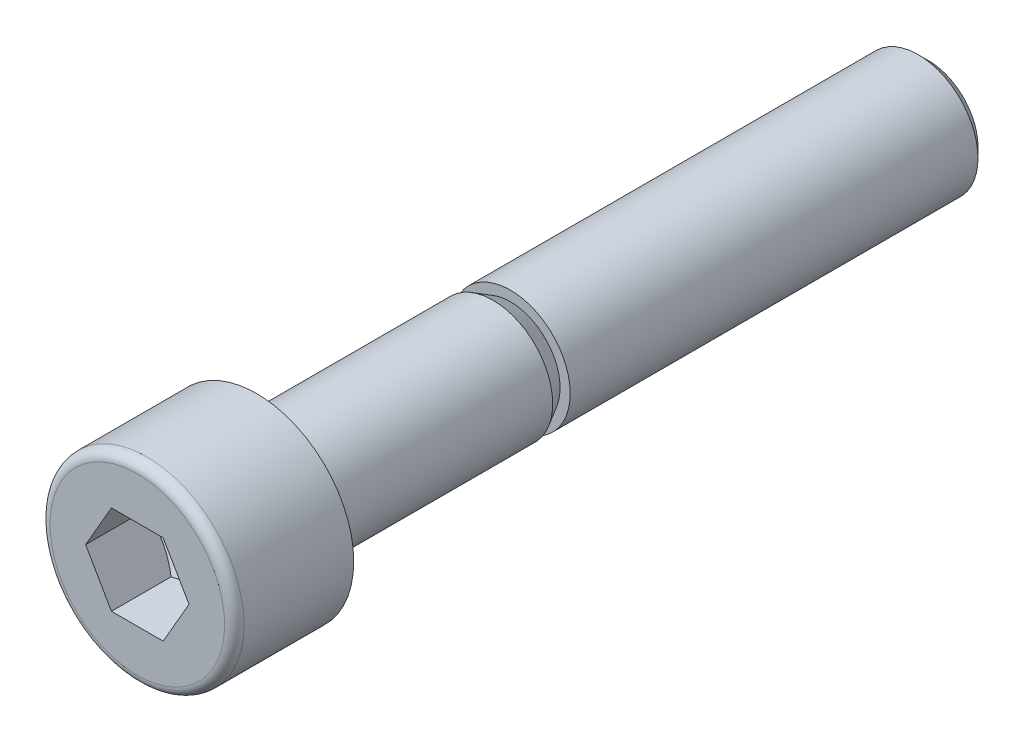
ISO-10303-21;
HEADER;
FILE_DESCRIPTION(('STEP AP214'),'2;1');
FILE_NAME('part.step','',(''),(''),'','','');
FILE_SCHEMA(('AUTOMOTIVE_DESIGN { 1 0 10303 214 1 1 1 1 }'));
ENDSEC;
DATA;
#1=APPLICATION_CONTEXT('core data for automotive mechanical design processes');
#2=APPLICATION_PROTOCOL_DEFINITION('international standard','automotive_design',2000,#1);
#3=PRODUCT_CONTEXT('',#1,'mechanical');
#4=PRODUCT('Part','Part','',(#3));
#5=PRODUCT_RELATED_PRODUCT_CATEGORY('part','',(#4));
#6=PRODUCT_DEFINITION_FORMATION('','',#4);
#7=PRODUCT_DEFINITION_CONTEXT('part definition',#1,'design');
#8=PRODUCT_DEFINITION('design','',#6,#7);
#9=PRODUCT_DEFINITION_SHAPE('','',#8);
#10=(LENGTH_UNIT() NAMED_UNIT(*) SI_UNIT(.MILLI.,.METRE.));
#11=(NAMED_UNIT(*) PLANE_ANGLE_UNIT() SI_UNIT($,.RADIAN.));
#12=(NAMED_UNIT(*) SI_UNIT($,.STERADIAN.) SOLID_ANGLE_UNIT());
#13=UNCERTAINTY_MEASURE_WITH_UNIT(LENGTH_MEASURE(1.E-05),#10,'distance_accuracy_value','');
#14=(GEOMETRIC_REPRESENTATION_CONTEXT(3) GLOBAL_UNCERTAINTY_ASSIGNED_CONTEXT((#13)) GLOBAL_UNIT_ASSIGNED_CONTEXT((#10,
#11,#12)) REPRESENTATION_CONTEXT('',''));
#15=CARTESIAN_POINT('',(0.,0.,0.));
#16=DIRECTION('',(0.,0.,1.));
#17=DIRECTION('',(1.,0.,0.));
#18=AXIS2_PLACEMENT_3D('',#15,#16,#17);
#19=CARTESIAN_POINT('',(1.63757896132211E-12,6.56592835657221E-13,8.));
#20=DIRECTION('',(0.,0.,1.));
#21=DIRECTION('',(1.00000000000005,0.,0.));
#22=AXIS2_PLACEMENT_3D('',#19,#20,#21);
#23=PLANE('',#22);
#24=CARTESIAN_POINT('',(1.63757896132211E-12,6.56592835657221E-13,8.));
#25=DIRECTION('',(0.,0.,1.));
#26=DIRECTION('',(1.00000000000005,0.,0.));
#27=AXIS2_PLACEMENT_3D('',#24,#25,#26);
#28=CIRCLE('',#27,5.85);
#29=CARTESIAN_POINT('',(5.85000000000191,7.71875618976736E-13,8.));
#30=VERTEX_POINT('',#29);
#31=EDGE_CURVE('E13',#30,#30,#28,.T.);
#32=ORIENTED_EDGE('',*,*,#31,.T.);
#33=EDGE_LOOP('',(#32));
#34=FACE_BOUND('',#33,.T.);
#35=DIRECTION('',(1.00000000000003,0.,0.));
#36=VECTOR('',#35,1.);
#37=CARTESIAN_POINT('',(-1.73204999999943,2.99999860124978,7.99999999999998));
#38=LINE('',#37,#36);
#39=CARTESIAN_POINT('',(-1.73204999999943,2.99999860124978,7.99999999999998));
#40=VERTEX_POINT('',#39);
#41=CARTESIAN_POINT('',(1.73205000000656,2.99999860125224,8.));
#42=VERTEX_POINT('',#41);
#43=EDGE_CURVE('E100',#40,#42,#38,.T.);
#44=ORIENTED_EDGE('',*,*,#43,.T.);
#45=DIRECTION('',(0.5,-0.86602540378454,0.));
#46=VECTOR('',#45,1.);
#47=CARTESIAN_POINT('',(1.73205000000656,2.99999860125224,8.));
#48=LINE('',#47,#46);
#49=CARTESIAN_POINT('',(3.46410000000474,2.00273825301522E-12,7.99999999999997));
#50=VERTEX_POINT('',#49);
#51=EDGE_CURVE('E39',#42,#50,#48,.T.);
#52=ORIENTED_EDGE('',*,*,#51,.T.);
#53=DIRECTION('',(-0.500000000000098,-0.866025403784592,0.));
#54=VECTOR('',#53,1.);
#55=CARTESIAN_POINT('',(3.46410000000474,2.00273825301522E-12,7.99999999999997));
#56=LINE('',#55,#54);
#57=CARTESIAN_POINT('',(1.73205000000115,-2.99999860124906,8.00000000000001));
#58=VERTEX_POINT('',#57);
#59=EDGE_CURVE('E177',#50,#58,#56,.T.);
#60=ORIENTED_EDGE('',*,*,#59,.T.);
#61=DIRECTION('',(-1.00000000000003,0.,0.));
#62=VECTOR('',#61,1.);
#63=CARTESIAN_POINT('',(1.73205000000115,-2.99999860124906,8.00000000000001));
#64=LINE('',#63,#62);
#65=CARTESIAN_POINT('',(-1.73204999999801,-2.99999860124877,7.99999999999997));
#66=VERTEX_POINT('',#65);
#67=EDGE_CURVE('E173',#58,#66,#64,.T.);
#68=ORIENTED_EDGE('',*,*,#67,.T.);
#69=DIRECTION('',(-0.5,0.86602540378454,0.));
#70=VECTOR('',#69,1.);
#71=CARTESIAN_POINT('',(-1.73204999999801,-2.99999860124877,7.99999999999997));
#72=LINE('',#71,#70);
#73=CARTESIAN_POINT('',(-3.46409999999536,1.93334931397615E-12,8.));
#74=VERTEX_POINT('',#73);
#75=EDGE_CURVE('E168',#66,#74,#72,.T.);
#76=ORIENTED_EDGE('',*,*,#75,.T.);
#77=DIRECTION('',(0.500000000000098,0.866025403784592,0.));
#78=VECTOR('',#77,1.);
#79=CARTESIAN_POINT('',(-3.46409999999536,1.93334931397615E-12,8.));
#80=LINE('',#79,#78);
#81=EDGE_CURVE('E104',#74,#40,#80,.T.);
#82=ORIENTED_EDGE('',*,*,#81,.T.);
#83=EDGE_LOOP('',(#44,#52,#60,#68,#76,#82));
#84=FACE_BOUND('',#83,.T.);
#85=ADVANCED_FACE('F25',(#34,#84),#23,.T.);
#86=CARTESIAN_POINT('',(3.33066907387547E-13,1.15359111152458E-13,7.35));
#87=DIRECTION('',(0.,0.,1.));
#88=DIRECTION('',(1.00000000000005,0.,0.));
#89=AXIS2_PLACEMENT_3D('',#86,#87,#88);
#90=TOROIDAL_SURFACE('',#89,5.85,0.65);
#91=ORIENTED_EDGE('',*,*,#31,.F.);
#92=EDGE_LOOP('',(#91));
#93=FACE_BOUND('',#92,.T.);
#94=CARTESIAN_POINT('',(3.33066907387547E-13,1.15359111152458E-13,7.35));
#95=DIRECTION('',(0.,0.,1.));
#96=DIRECTION('',(1.00000000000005,0.,0.));
#97=AXIS2_PLACEMENT_3D('',#94,#95,#96);
#98=CIRCLE('',#97,6.5);
#99=CARTESIAN_POINT('',(6.50000000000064,2.43451092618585E-13,7.35));
#100=VERTEX_POINT('',#99);
#101=EDGE_CURVE('E32',#100,#100,#98,.T.);
#102=ORIENTED_EDGE('',*,*,#101,.T.);
#103=EDGE_LOOP('',(#102));
#104=FACE_BOUND('',#103,.T.);
#105=ADVANCED_FACE('F141',(#93,#104),#90,.T.);
#106=CARTESIAN_POINT('',(1.63757896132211E-12,6.56592835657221E-13,8.));
#107=DIRECTION('',(0.,0.,1.));
#108=DIRECTION('',(1.00000000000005,0.,0.));
#109=AXIS2_PLACEMENT_3D('',#106,#107,#108);
#110=CYLINDRICAL_SURFACE('',#109,6.5);
#111=CARTESIAN_POINT('',(0.,0.,0.));
#112=DIRECTION('',(0.,0.,1.));
#113=DIRECTION('',(1.00000000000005,0.,0.));
#114=AXIS2_PLACEMENT_3D('',#111,#112,#113);
#115=CIRCLE('',#114,6.5);
#116=CARTESIAN_POINT('',(6.50000000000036,1.04673214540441E-13,0.));
#117=VERTEX_POINT('',#116);
#118=EDGE_CURVE('E136',#117,#117,#115,.T.);
#119=ORIENTED_EDGE('',*,*,#118,.T.);
#120=EDGE_LOOP('',(#119));
#121=FACE_BOUND('',#120,.T.);
#122=ORIENTED_EDGE('',*,*,#101,.F.);
#123=EDGE_LOOP('',(#122));
#124=FACE_BOUND('',#123,.T.);
#125=ADVANCED_FACE('F143',(#121,#124),#110,.T.);
#126=CARTESIAN_POINT('',(1.2490009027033E-12,6.50000000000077,0.));
#127=DIRECTION('',(0.,0.,-1.));
#128=DIRECTION('',(-1.00000000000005,0.,0.));
#129=AXIS2_PLACEMENT_3D('',#126,#127,#128);
#130=PLANE('',#129);
#131=CARTESIAN_POINT('',(0.,0.,0.));
#132=DIRECTION('',(0.,0.,1.));
#133=DIRECTION('',(1.00000000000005,0.,0.));
#134=AXIS2_PLACEMENT_3D('',#131,#132,#133);
#135=CIRCLE('',#134,4.4);
#136=CARTESIAN_POINT('',(4.40000000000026,0.,0.));
#137=VERTEX_POINT('',#136);
#138=EDGE_CURVE('E133',#137,#137,#135,.T.);
#139=ORIENTED_EDGE('',*,*,#138,.T.);
#140=EDGE_LOOP('',(#139));
#141=FACE_BOUND('',#140,.T.);
#142=ORIENTED_EDGE('',*,*,#118,.F.);
#143=EDGE_LOOP('',(#142));
#144=FACE_BOUND('',#143,.T.);
#145=ADVANCED_FACE('F145',(#141,#144),#130,.T.);
#146=CARTESIAN_POINT('',(0.,0.,-0.399999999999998));
#147=DIRECTION('',(0.,0.,1.));
#148=DIRECTION('',(1.00000000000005,0.,0.));
#149=AXIS2_PLACEMENT_3D('',#146,#147,#148);
#150=TOROIDAL_SURFACE('',#149,4.4,0.4);
#151=CARTESIAN_POINT('',(0.,0.,-0.399999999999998));
#152=DIRECTION('',(0.,0.,1.));
#153=DIRECTION('',(1.00000000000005,0.,0.));
#154=AXIS2_PLACEMENT_3D('',#151,#152,#153);
#155=CIRCLE('',#154,4.);
#156=CARTESIAN_POINT('',(4.00000000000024,0.,-0.399999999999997));
#157=VERTEX_POINT('',#156);
#158=EDGE_CURVE('E130',#157,#157,#155,.T.);
#159=ORIENTED_EDGE('',*,*,#158,.T.);
#160=EDGE_LOOP('',(#159));
#161=FACE_BOUND('',#160,.T.);
#162=ORIENTED_EDGE('',*,*,#138,.F.);
#163=EDGE_LOOP('',(#162));
#164=FACE_BOUND('',#163,.T.);
#165=ADVANCED_FACE('F153',(#161,#164),#150,.F.);
#166=CARTESIAN_POINT('',(1.63757896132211E-12,6.56592835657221E-13,8.));
#167=DIRECTION('',(0.,0.,1.));
#168=DIRECTION('',(1.00000000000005,0.,0.));
#169=AXIS2_PLACEMENT_3D('',#166,#167,#168);
#170=CYLINDRICAL_SURFACE('',#169,4.);
#171=CARTESIAN_POINT('',(4.19109191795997E-12,1.32272665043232E-12,-15.8281593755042));
#172=DIRECTION('',(0.,0.,1.));
#173=DIRECTION('',(1.00000000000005,0.,0.));
#174=AXIS2_PLACEMENT_3D('',#171,#172,#173);
#175=CIRCLE('',#174,4.);
#176=CARTESIAN_POINT('',(4.00000000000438,1.4015524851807E-12,-15.8281593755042));
#177=VERTEX_POINT('',#176);
#178=EDGE_CURVE('E127',#177,#177,#175,.T.);
#179=ORIENTED_EDGE('',*,*,#178,.T.);
#180=EDGE_LOOP('',(#179));
#181=FACE_BOUND('',#180,.T.);
#182=ORIENTED_EDGE('',*,*,#158,.F.);
#183=EDGE_LOOP('',(#182));
#184=FACE_BOUND('',#183,.T.);
#185=ADVANCED_FACE('F276',(#181,#184),#170,.T.);
#186=CARTESIAN_POINT('',(4.19109191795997E-12,1.32272665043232E-12,-15.8281593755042));
#187=DIRECTION('',(0.,0.,1.));
#188=DIRECTION('',(1.00000000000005,0.,0.));
#189=AXIS2_PLACEMENT_3D('',#186,#187,#188);
#190=CONICAL_SURFACE('',#189,4.,0.523598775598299);
#191=CARTESIAN_POINT('',(2.80331313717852E-12,1.65579355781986E-12,-17.));
#192=DIRECTION('',(0.,0.,1.));
#193=DIRECTION('',(1.00000000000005,0.,0.));
#194=AXIS2_PLACEMENT_3D('',#191,#192,#193);
#195=CIRCLE('',#194,3.3234375);
#196=CARTESIAN_POINT('',(3.32343750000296,1.72128674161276E-12,-17.));
#197=VERTEX_POINT('',#196);
#198=EDGE_CURVE('E124',#197,#197,#195,.T.);
#199=ORIENTED_EDGE('',*,*,#198,.T.);
#200=EDGE_LOOP('',(#199));
#201=FACE_BOUND('',#200,.T.);
#202=ORIENTED_EDGE('',*,*,#178,.F.);
#203=EDGE_LOOP('',(#202));
#204=FACE_BOUND('',#203,.T.);
#205=ADVANCED_FACE('F272',(#201,#204),#190,.T.);
#206=CARTESIAN_POINT('',(2.58126853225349E-12,3.32343750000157,-17.));
#207=DIRECTION('',(0.,0.,1.));
#208=DIRECTION('',(1.00000000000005,0.,0.));
#209=AXIS2_PLACEMENT_3D('',#206,#207,#208);
#210=PLANE('',#209);
#211=CARTESIAN_POINT('',(2.80331313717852E-12,1.65579355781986E-12,-17.));
#212=DIRECTION('',(0.,0.,1.));
#213=DIRECTION('',(1.00000000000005,0.,0.));
#214=AXIS2_PLACEMENT_3D('',#211,#212,#213);
#215=CIRCLE('',#214,4.);
#216=CARTESIAN_POINT('',(4.00000000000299,1.73461939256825E-12,-17.));
#217=VERTEX_POINT('',#216);
#218=EDGE_CURVE('E121',#217,#217,#215,.T.);
#219=ORIENTED_EDGE('',*,*,#218,.T.);
#220=EDGE_LOOP('',(#219));
#221=FACE_BOUND('',#220,.T.);
#222=ORIENTED_EDGE('',*,*,#198,.F.);
#223=EDGE_LOOP('',(#222));
#224=FACE_BOUND('',#223,.T.);
#225=ADVANCED_FACE('F268',(#221,#224),#210,.T.);
#226=CARTESIAN_POINT('',(1.63757896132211E-12,6.56592835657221E-13,8.));
#227=DIRECTION('',(0.,0.,1.));
#228=DIRECTION('',(1.00000000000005,0.,0.));
#229=AXIS2_PLACEMENT_3D('',#226,#227,#228);
#230=CYLINDRICAL_SURFACE('',#229,4.);
#231=CARTESIAN_POINT('',(2.22044604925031E-13,1.15359111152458E-13,-44.3234375));
#232=DIRECTION('',(0.,0.,1.));
#233=DIRECTION('',(1.00000000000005,0.,0.));
#234=AXIS2_PLACEMENT_3D('',#231,#232,#233);
#235=CIRCLE('',#234,4.);
#236=CARTESIAN_POINT('',(4.00000000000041,1.94184945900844E-13,-44.3234375));
#237=VERTEX_POINT('',#236);
#238=EDGE_CURVE('E118',#237,#237,#235,.T.);
#239=ORIENTED_EDGE('',*,*,#238,.T.);
#240=EDGE_LOOP('',(#239));
#241=FACE_BOUND('',#240,.T.);
#242=ORIENTED_EDGE('',*,*,#218,.F.);
#243=EDGE_LOOP('',(#242));
#244=FACE_BOUND('',#243,.T.);
#245=ADVANCED_FACE('F261',(#241,#244),#230,.T.);
#246=CARTESIAN_POINT('',(2.22044604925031E-13,1.15359111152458E-13,-44.3234375));
#247=DIRECTION('',(0.,0.,1.));
#248=DIRECTION('',(1.00000000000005,0.,0.));
#249=AXIS2_PLACEMENT_3D('',#246,#247,#248);
#250=CONICAL_SURFACE('',#249,4.,0.785398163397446);
#251=CARTESIAN_POINT('',(4.8017145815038E-12,1.61416019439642E-12,-45.));
#252=DIRECTION('',(0.,0.,1.));
#253=DIRECTION('',(1.00000000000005,0.,0.));
#254=AXIS2_PLACEMENT_3D('',#251,#252,#253);
#255=CIRCLE('',#254,3.3234375);
#256=CARTESIAN_POINT('',(3.32343750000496,1.67965337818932E-12,-45.));
#257=VERTEX_POINT('',#256);
#258=EDGE_CURVE('E115',#257,#257,#255,.T.);
#259=ORIENTED_EDGE('',*,*,#258,.T.);
#260=EDGE_LOOP('',(#259));
#261=FACE_BOUND('',#260,.T.);
#262=ORIENTED_EDGE('',*,*,#238,.F.);
#263=EDGE_LOOP('',(#262));
#264=FACE_BOUND('',#263,.T.);
#265=ADVANCED_FACE('F256',(#261,#264),#250,.T.);
#266=CARTESIAN_POINT('',(7.13318293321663E-12,3.32343750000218,-45.0000000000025));
#267=DIRECTION('',(0.,0.,-1.));
#268=DIRECTION('',(-1.00000000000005,0.,0.));
#269=AXIS2_PLACEMENT_3D('',#266,#267,#268);
#270=PLANE('',#269);
#271=ORIENTED_EDGE('',*,*,#258,.F.);
#272=EDGE_LOOP('',(#271));
#273=FACE_BOUND('',#272,.T.);
#274=ADVANCED_FACE('F233',(#273),#270,.T.);
#275=CARTESIAN_POINT('',(1.73205000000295,2.99999860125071,2.00000093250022));
#276=DIRECTION('',(-0.86602540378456,-0.500000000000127,0.));
#277=DIRECTION('',(-0.5,0.86602540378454,0.));
#278=AXIS2_PLACEMENT_3D('',#275,#276,#277);
#279=PLANE('',#278);
#280=DIRECTION('',(0.,0.,1.));
#281=VECTOR('',#280,1.);
#282=CARTESIAN_POINT('',(3.46410000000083,1.07292646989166E-12,2.00000093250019));
#283=LINE('',#282,#281);
#284=CARTESIAN_POINT('',(3.46410000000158,1.10068204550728E-12,3.99999999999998));
#285=VERTEX_POINT('',#284);
#286=EDGE_CURVE('E113',#285,#50,#283,.T.);
#287=ORIENTED_EDGE('',*,*,#286,.T.);
#288=ORIENTED_EDGE('',*,*,#51,.F.);
#289=DIRECTION('',(0.,0.,1.));
#290=VECTOR('',#289,1.);
#291=CARTESIAN_POINT('',(1.73205000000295,2.99999860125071,2.00000093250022));
#292=LINE('',#291,#290);
#293=CARTESIAN_POINT('',(1.73205000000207,2.99999860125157,4.));
#294=VERTEX_POINT('',#293);
#295=EDGE_CURVE('E94',#294,#42,#292,.T.);
#296=ORIENTED_EDGE('',*,*,#295,.F.);
#297=CARTESIAN_POINT('',(3.46410011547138,-1.99998985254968E-07,4.00000006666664));
#298=CARTESIAN_POINT('',(3.38798700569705,0.131831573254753,3.95604339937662));
#299=CARTESIAN_POINT('',(3.31121688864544,0.264801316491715,3.91606711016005));
#300=CARTESIAN_POINT('',(3.15634743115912,0.53304308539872,3.84628969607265));
#301=CARTESIAN_POINT('',(3.07824533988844,0.668319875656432,3.81651325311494));
#302=CARTESIAN_POINT('',(2.92300903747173,0.937197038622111,3.77016407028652));
#303=CARTESIAN_POINT('',(2.84589870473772,1.07075605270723,3.75328281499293));
#304=CARTESIAN_POINT('',(2.69131539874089,1.33850219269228,3.73313388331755));
#305=CARTESIAN_POINT('',(2.6138429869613,1.47268834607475,3.72984951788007));
#306=CARTESIAN_POINT('',(2.46909408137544,1.72340080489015,3.73669954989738));
#307=CARTESIAN_POINT('',(2.40179586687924,1.83996473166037,3.74515203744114));
#308=CARTESIAN_POINT('',(2.26763786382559,2.07233320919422,3.77193605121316));
#309=CARTESIAN_POINT('',(2.20077853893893,2.18813695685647,3.79027671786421));
#310=CARTESIAN_POINT('',(2.06634415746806,2.42098413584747,3.8361248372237));
#311=CARTESIAN_POINT('',(1.9987861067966,2.53799811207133,3.8638265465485));
#312=CARTESIAN_POINT('',(1.86467734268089,2.77028130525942,3.92669771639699));
#313=CARTESIAN_POINT('',(1.79812491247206,2.88555349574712,3.9618524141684));
#314=CARTESIAN_POINT('',(1.73204988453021,2.9999988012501,4.00000006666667));
#315=B_SPLINE_CURVE_WITH_KNOTS('',3,(#297,#298,#299,#300,#301,#302,#303,#304,#305,#306,#307,
#308,#309,#310,#311,#312,#313,#314),.UNSPECIFIED.,.F.,.F.,(4,2,2,2,2,2,2,2,4),(0.,
0.475523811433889,0.95219031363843,1.41706079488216,1.88136051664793,2.28556077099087,
2.69013530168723,3.1036813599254,3.51641580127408),.UNSPECIFIED.);
#316=EDGE_CURVE('E87',#285,#294,#315,.T.);
#317=ORIENTED_EDGE('',*,*,#316,.F.);
#318=EDGE_LOOP('',(#287,#288,#296,#317));
#319=FACE_BOUND('',#318,.T.);
#320=ADVANCED_FACE('F95',(#319),#279,.T.);
#321=CARTESIAN_POINT('',(3.46410000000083,1.07292646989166E-12,2.00000093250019));
#322=DIRECTION('',(-0.866025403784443,0.500000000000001,0.));
#323=DIRECTION('',(0.500000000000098,0.866025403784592,0.));
#324=AXIS2_PLACEMENT_3D('',#321,#322,#323);
#325=PLANE('',#324);
#326=DIRECTION('',(0.,0.,1.));
#327=VECTOR('',#326,1.);
#328=CARTESIAN_POINT('',(1.73205000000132,-2.99999860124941,2.00000093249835));
#329=LINE('',#328,#327);
#330=CARTESIAN_POINT('',(1.7320500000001,-2.99999860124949,3.99999999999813));
#331=VERTEX_POINT('',#330);
#332=EDGE_CURVE('E111',#331,#58,#329,.T.);
#333=ORIENTED_EDGE('',*,*,#332,.T.);
#334=ORIENTED_EDGE('',*,*,#59,.F.);
#335=ORIENTED_EDGE('',*,*,#286,.F.);
#336=CARTESIAN_POINT('',(1.73204988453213,-2.99999880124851,4.0000000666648));
#337=CARTESIAN_POINT('',(1.80816299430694,-2.86816702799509,3.9560433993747));
#338=CARTESIAN_POINT('',(1.8849331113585,-2.73519728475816,3.91606711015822));
#339=CARTESIAN_POINT('',(2.03980256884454,-2.46695551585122,3.84628969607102));
#340=CARTESIAN_POINT('',(2.11790466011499,-2.33167872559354,3.8165132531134));
#341=CARTESIAN_POINT('',(2.27314096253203,-2.06280156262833,3.77016407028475));
#342=CARTESIAN_POINT('',(2.3502512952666,-1.92924254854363,3.75328281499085));
#343=CARTESIAN_POINT('',(2.50483460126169,-1.66149640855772,3.7331338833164));
#344=CARTESIAN_POINT('',(2.582307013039,-1.52731025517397,3.72984951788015));
#345=CARTESIAN_POINT('',(2.72705591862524,-1.27659779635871,3.73669954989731));
#346=CARTESIAN_POINT('',(2.79435413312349,-1.16003386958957,3.74515203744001));
#347=CARTESIAN_POINT('',(2.92851213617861,-0.927665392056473,3.77193605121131));
#348=CARTESIAN_POINT('',(2.99537146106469,-0.811861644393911,3.79027671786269));
#349=CARTESIAN_POINT('',(3.1298058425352,-0.579014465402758,3.83612483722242));
#350=CARTESIAN_POINT('',(3.1973638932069,-0.462000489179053,3.8638265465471));
#351=CARTESIAN_POINT('',(3.33147265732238,-0.229717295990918,3.92669771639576));
#352=CARTESIAN_POINT('',(3.39802508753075,-0.114445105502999,3.96185241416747));
#353=CARTESIAN_POINT('',(3.46410011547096,2.00000728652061E-07,4.00000006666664));
#354=B_SPLINE_CURVE_WITH_KNOTS('',3,(#336,#337,#338,#339,#340,#341,#342,#343,#344,#345,#346,
#347,#348,#349,#350,#351,#352,#353),.UNSPECIFIED.,.F.,.F.,(4,2,2,2,2,2,2,2,4),(0.,
0.47552381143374,0.952190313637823,1.41706079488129,1.88136051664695,2.28556077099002,
2.6901353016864,3.10368135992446,3.51641580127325),.UNSPECIFIED.);
#355=EDGE_CURVE('E91',#331,#285,#354,.T.);
#356=ORIENTED_EDGE('',*,*,#355,.F.);
#357=EDGE_LOOP('',(#333,#334,#335,#356));
#358=FACE_BOUND('',#357,.T.);
#359=ADVANCED_FACE('F224',(#358),#325,.T.);
#360=CARTESIAN_POINT('',(1.73205000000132,-2.99999860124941,2.00000093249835));
#361=DIRECTION('',(0.,1.00000000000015,0.));
#362=DIRECTION('',(1.00000000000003,0.,0.));
#363=AXIS2_PLACEMENT_3D('',#360,#361,#362);
#364=PLANE('',#363);
#365=DIRECTION('',(0.,0.,1.));
#366=VECTOR('',#365,1.);
#367=CARTESIAN_POINT('',(-1.7320499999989,-2.99999860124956,2.00000093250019));
#368=LINE('',#367,#366);
#369=CARTESIAN_POINT('',(-1.73204999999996,-2.99999860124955,3.99999999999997));
#370=VERTEX_POINT('',#369);
#371=EDGE_CURVE('E109',#370,#66,#368,.T.);
#372=ORIENTED_EDGE('',*,*,#371,.T.);
#373=ORIENTED_EDGE('',*,*,#67,.F.);
#374=ORIENTED_EDGE('',*,*,#332,.F.);
#375=CARTESIAN_POINT('',(-4.48543327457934,-2.99999860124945,5.11550534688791));
#376=CARTESIAN_POINT('',(-4.35588300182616,-2.99999860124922,5.05335202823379));
#377=CARTESIAN_POINT('',(-4.2260171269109,-2.99999860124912,4.99184428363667));
#378=CARTESIAN_POINT('',(-3.9654859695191,-2.99999860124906,4.87048616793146));
#379=CARTESIAN_POINT('',(-3.83482054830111,-2.9999986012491,4.81063609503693));
#380=CARTESIAN_POINT('',(-3.57177288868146,-2.99999860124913,4.69262519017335));
#381=CARTESIAN_POINT('',(-3.43938504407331,-2.99999860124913,4.63447680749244));
#382=CARTESIAN_POINT('',(-3.17349843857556,-2.99999860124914,4.52078755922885));
#383=CARTESIAN_POINT('',(-3.03999973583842,-2.99999860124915,4.46524655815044));
#384=CARTESIAN_POINT('',(-2.76816246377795,-2.99999860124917,4.35605208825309));
#385=CARTESIAN_POINT('',(-2.62978861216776,-2.99999860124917,4.30248593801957));
#386=CARTESIAN_POINT('',(-2.35136718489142,-2.99999860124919,4.19980717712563));
#387=CARTESIAN_POINT('',(-2.21131941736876,-2.9999986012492,4.15069508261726));
#388=CARTESIAN_POINT('',(-1.92964461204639,-2.99999860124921,4.05832683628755));
#389=CARTESIAN_POINT('',(-1.78802198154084,-2.9999986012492,4.01505738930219));
#390=CARTESIAN_POINT('',(-1.50275951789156,-2.99999860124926,3.93586037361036));
#391=CARTESIAN_POINT('',(-1.35912038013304,-2.99999860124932,3.89993033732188));
#392=CARTESIAN_POINT('',(-1.07010555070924,-2.99999860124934,3.83732117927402));
#393=CARTESIAN_POINT('',(-0.924733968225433,-2.99999860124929,3.81062345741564));
#394=CARTESIAN_POINT('',(-0.63236440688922,-2.99999860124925,3.7682293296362));
#395=CARTESIAN_POINT('',(-0.485366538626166,-2.99999860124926,3.75253218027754));
#396=CARTESIAN_POINT('',(-0.192319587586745,-2.99999860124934,3.73359558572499));
#397=CARTESIAN_POINT('',(-0.0462802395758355,-2.99999860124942,3.73020913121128));
#398=CARTESIAN_POINT('',(0.245570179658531,-2.99999860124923,3.73580306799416));
#399=CARTESIAN_POINT('',(0.391381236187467,-2.99999860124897,3.74478422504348));
#400=CARTESIAN_POINT('',(0.643868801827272,-2.99999860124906,3.77043931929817));
#401=CARTESIAN_POINT('',(0.750824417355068,-2.99999860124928,3.78449289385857));
#402=CARTESIAN_POINT('',(0.963839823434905,-2.99999860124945,3.81828752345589));
#403=CARTESIAN_POINT('',(1.06989946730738,-2.9999986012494,3.83802949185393));
#404=CARTESIAN_POINT('',(1.38665231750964,-2.99999860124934,3.90473774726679));
#405=CARTESIAN_POINT('',(1.59578448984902,-2.99999860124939,3.95917098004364));
#406=CARTESIAN_POINT('',(1.90847464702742,-2.99999860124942,4.05215904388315));
#407=CARTESIAN_POINT('',(2.01368123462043,-2.99999860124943,4.08547388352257));
#408=CARTESIAN_POINT('',(2.22307127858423,-2.99999860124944,4.1552055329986));
#409=CARTESIAN_POINT('',(2.32725472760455,-2.99999860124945,4.1916223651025));
#410=CARTESIAN_POINT('',(2.53464013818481,-2.99999860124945,4.26700365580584));
#411=CARTESIAN_POINT('',(2.63784247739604,-2.99999860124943,4.30596708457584));
#412=CARTESIAN_POINT('',(2.84341531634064,-2.9999986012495,4.38601920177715));
#413=CARTESIAN_POINT('',(2.94578582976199,-2.99999860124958,4.42710785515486));
#414=CARTESIAN_POINT('',(3.20709883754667,-2.99999860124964,4.53462485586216));
#415=CARTESIAN_POINT('',(3.36551841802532,-2.99999860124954,4.60232247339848));
#416=CARTESIAN_POINT('',(3.68093032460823,-2.99999860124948,4.74097445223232));
#417=CARTESIAN_POINT('',(3.83792254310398,-2.99999860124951,4.81192905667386));
#418=CARTESIAN_POINT('',(4.15078500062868,-2.99999860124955,4.95636009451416));
#419=CARTESIAN_POINT('',(4.30665496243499,-2.99999860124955,5.02983712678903));
#420=CARTESIAN_POINT('',(4.61745612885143,-2.99999860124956,5.17875355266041));
#421=CARTESIAN_POINT('',(4.77238731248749,-2.99999860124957,5.25419298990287));
#422=CARTESIAN_POINT('',(5.23640411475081,-2.9999986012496,5.48299925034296));
#423=CARTESIAN_POINT('',(5.54434651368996,-2.99999860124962,5.63868230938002));
#424=CARTESIAN_POINT('',(6.15811760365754,-2.99999860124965,5.95402730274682));
#425=CARTESIAN_POINT('',(6.46394659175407,-2.99999860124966,6.1136886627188));
#426=CARTESIAN_POINT('',(7.04534859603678,-2.9999986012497,6.42057513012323));
#427=CARTESIAN_POINT('',(7.3210529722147,-2.99999860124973,6.56755177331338));
#428=CARTESIAN_POINT('',(7.87157644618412,-2.99999860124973,6.86317920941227));
#429=CARTESIAN_POINT('',(8.14639550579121,-2.99999860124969,7.01183007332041));
#430=CARTESIAN_POINT('',(8.69465217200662,-2.99999860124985,7.31000711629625));
#431=CARTESIAN_POINT('',(8.96809151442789,-2.99999860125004,7.459530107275));
#432=CARTESIAN_POINT('',(9.51441589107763,-2.99999860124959,7.75954846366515));
#433=CARTESIAN_POINT('',(9.78730095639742,-2.99999860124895,7.91004377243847));
#434=CARTESIAN_POINT('',(10.0599874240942,-2.99999860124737,8.06089576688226));
#435=B_SPLINE_CURVE_WITH_KNOTS('',3,(#375,#376,#377,#378,#379,#380,#381,#382,#383,#384,#385,
#386,#387,#388,#389,#390,#391,#392,#393,#394,#395,#396,#397,#398,#399,#400,#401,#402,#403,#404,
#405,#406,#407,#408,#409,#410,#411,#412,#413,#414,#415,#416,#417,#418,#419,#420,#421,#422,#423,
#424,#425,#426,#427,#428,#429,#430,#431,#432,#433,#434),.UNSPECIFIED.,.F.,.F.,(4,2,2,2,2,2,2,2,
2,2,2,2,2,2,2,2,2,2,2,2,2,2,2,2,2,2,2,2,2,4),(0.,0.431070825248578,0.862218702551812,
1.29598193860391,1.72972260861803,2.17480373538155,2.61993637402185,3.06403838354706,
3.50799083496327,3.95104358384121,4.39406638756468,4.83178108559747,5.2695228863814,
5.59298785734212,5.9165047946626,6.56394435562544,6.89498708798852,7.22603219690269,
7.55694425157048,7.88785084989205,8.40463217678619,8.9214521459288,9.43839567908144,
9.9553507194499,10.9904746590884,12.0254500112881,12.9627443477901,13.9000785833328,
14.8350286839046,15.7699248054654),.UNSPECIFIED.);
#436=EDGE_CURVE('E215',#370,#331,#435,.T.);
#437=ORIENTED_EDGE('',*,*,#436,.F.);
#438=EDGE_LOOP('',(#372,#373,#374,#437));
#439=FACE_BOUND('',#438,.T.);
#440=ADVANCED_FACE('F220',(#439),#364,.T.);
#441=CARTESIAN_POINT('',(-1.7320499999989,-2.99999860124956,2.00000093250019));
#442=DIRECTION('',(0.86602540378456,0.500000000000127,0.));
#443=DIRECTION('',(0.5,-0.86602540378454,0.));
#444=AXIS2_PLACEMENT_3D('',#441,#442,#443);
#445=PLANE('',#444);
#446=DIRECTION('',(0.,0.,1.));
#447=VECTOR('',#446,1.);
#448=CARTESIAN_POINT('',(-3.46409999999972,1.70870262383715E-13,2.00000093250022));
#449=LINE('',#448,#447);
#450=CARTESIAN_POINT('',(-3.46409999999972,8.78637440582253E-13,4.));
#451=VERTEX_POINT('',#450);
#452=EDGE_CURVE('E102',#451,#74,#449,.T.);
#453=ORIENTED_EDGE('',*,*,#452,.T.);
#454=ORIENTED_EDGE('',*,*,#75,.F.);
#455=ORIENTED_EDGE('',*,*,#371,.F.);
#456=CARTESIAN_POINT('',(-3.46410011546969,2.00000575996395E-07,4.00000006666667));
#457=CARTESIAN_POINT('',(-3.38798700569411,-0.131831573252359,3.95604339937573));
#458=CARTESIAN_POINT('',(-3.31121688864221,-0.264801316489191,3.91606711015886));
#459=CARTESIAN_POINT('',(-3.15634743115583,-0.533043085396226,3.84628969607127));
#460=CARTESIAN_POINT('',(-3.07824533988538,-0.668319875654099,3.81651325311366));
#461=CARTESIAN_POINT('',(-2.92300903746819,-0.937197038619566,3.77016407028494));
#462=CARTESIAN_POINT('',(-2.84589870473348,-1.07075605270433,3.75328281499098));
#463=CARTESIAN_POINT('',(-2.69131539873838,-1.33850219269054,3.73313388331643));
#464=CARTESIAN_POINT('',(-2.61384298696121,-1.47268834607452,3.72984951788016));
#465=CARTESIAN_POINT('',(-2.46909408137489,-1.72340080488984,3.73669954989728));
#466=CARTESIAN_POINT('',(-2.40179586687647,-1.83996473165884,3.74515203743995));
#467=CARTESIAN_POINT('',(-2.26763786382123,-2.07233320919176,3.77193605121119));
#468=CARTESIAN_POINT('',(-2.20077853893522,-2.18813695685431,3.79027671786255));
#469=CARTESIAN_POINT('',(-2.06634415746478,-2.42098413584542,3.83612483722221));
#470=CARTESIAN_POINT('',(-1.99878610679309,-2.53799811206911,3.86382654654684));
#471=CARTESIAN_POINT('',(-1.86467734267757,-2.77028130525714,3.92669771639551));
#472=CARTESIAN_POINT('',(-1.79812491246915,-2.88555349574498,3.96185241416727));
#473=CARTESIAN_POINT('',(-1.73204988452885,-2.99999880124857,4.00000006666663));
#474=B_SPLINE_CURVE_WITH_KNOTS('',3,(#456,#457,#458,#459,#460,#461,#462,#463,#464,#465,#466,
#467,#468,#469,#470,#471,#472,#473),.UNSPECIFIED.,.F.,.F.,(4,2,2,2,2,2,2,2,4),(0.,
0.475523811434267,0.952190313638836,1.4170607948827,1.88136051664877,2.28556077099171,
2.69013530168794,3.10368135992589,3.5164158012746),.UNSPECIFIED.);
#475=EDGE_CURVE('E210',#451,#370,#474,.T.);
#476=ORIENTED_EDGE('',*,*,#475,.F.);
#477=EDGE_LOOP('',(#453,#454,#455,#476));
#478=FACE_BOUND('',#477,.T.);
#479=ADVANCED_FACE('F223',(#478),#445,.T.);
#480=CARTESIAN_POINT('',(-3.46409999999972,1.70870262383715E-13,2.00000093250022));
#481=DIRECTION('',(0.866025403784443,-0.500000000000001,0.));
#482=DIRECTION('',(-0.500000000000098,-0.866025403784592,0.));
#483=AXIS2_PLACEMENT_3D('',#480,#481,#482);
#484=PLANE('',#483);
#485=DIRECTION('',(0.,0.,1.));
#486=VECTOR('',#485,1.);
#487=CARTESIAN_POINT('',(-1.73204999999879,2.99999860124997,2.00000093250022));
#488=LINE('',#487,#486);
#489=CARTESIAN_POINT('',(-1.73204999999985,2.99999860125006,4.));
#490=VERTEX_POINT('',#489);
#491=EDGE_CURVE('E99',#490,#40,#488,.T.);
#492=ORIENTED_EDGE('',*,*,#491,.T.);
#493=ORIENTED_EDGE('',*,*,#81,.F.);
#494=ORIENTED_EDGE('',*,*,#452,.F.);
#495=CARTESIAN_POINT('',(-1.73204988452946,2.99999880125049,4.00000006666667));
#496=CARTESIAN_POINT('',(-1.80816299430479,2.86816702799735,3.9560433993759));
#497=CARTESIAN_POINT('',(-1.88493311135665,2.73519728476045,3.91606711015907));
#498=CARTESIAN_POINT('',(-2.03980256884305,2.46695551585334,3.84628969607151));
#499=CARTESIAN_POINT('',(-2.11790466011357,2.33167872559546,3.81651325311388));
#500=CARTESIAN_POINT('',(-2.27314096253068,2.06280156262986,3.77016407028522));
#501=CARTESIAN_POINT('',(-2.35025129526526,1.92924254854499,3.75328281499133));
#502=CARTESIAN_POINT('',(-2.50483460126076,1.66149640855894,3.73313388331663));
#503=CARTESIAN_POINT('',(-2.58230701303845,1.52731025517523,3.72984951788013));
#504=CARTESIAN_POINT('',(-2.7270559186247,1.27659779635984,3.73669954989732));
#505=CARTESIAN_POINT('',(-2.79435413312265,1.16003386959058,3.74515203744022));
#506=CARTESIAN_POINT('',(-2.92851213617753,0.927665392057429,3.77193605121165));
#507=CARTESIAN_POINT('',(-2.99537146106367,0.81186164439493,3.79027671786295));
#508=CARTESIAN_POINT('',(-3.12980584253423,0.57901446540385,3.83612483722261));
#509=CARTESIAN_POINT('',(-3.19736389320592,0.462000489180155,3.8638265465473));
#510=CARTESIAN_POINT('',(-3.33147265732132,0.229717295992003,3.92669771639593));
#511=CARTESIAN_POINT('',(-3.39802508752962,0.114445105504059,3.9618524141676));
#512=CARTESIAN_POINT('',(-3.46410011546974,-1.99999720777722E-07,4.00000006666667));
#513=B_SPLINE_CURVE_WITH_KNOTS('',3,(#495,#496,#497,#498,#499,#500,#501,#502,#503,#504,#505,
#506,#507,#508,#509,#510,#511,#512),.UNSPECIFIED.,.F.,.F.,(4,2,2,2,2,2,2,2,4),(0.,
0.47552381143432,0.952190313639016,1.41706079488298,1.88136051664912,2.28556077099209,
2.69013530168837,3.10368135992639,3.51641580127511),.UNSPECIFIED.);
#514=EDGE_CURVE('E47',#490,#451,#513,.T.);
#515=ORIENTED_EDGE('',*,*,#514,.F.);
#516=EDGE_LOOP('',(#492,#493,#494,#515));
#517=FACE_BOUND('',#516,.T.);
#518=ADVANCED_FACE('F167',(#517),#484,.T.);
#519=CARTESIAN_POINT('',(-1.73204999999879,2.99999860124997,2.00000093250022));
#520=DIRECTION('',(0.,-1.00000000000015,0.));
#521=DIRECTION('',(-1.00000000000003,0.,0.));
#522=AXIS2_PLACEMENT_3D('',#519,#520,#521);
#523=PLANE('',#522);
#524=ORIENTED_EDGE('',*,*,#295,.T.);
#525=ORIENTED_EDGE('',*,*,#43,.F.);
#526=ORIENTED_EDGE('',*,*,#491,.F.);
#527=CARTESIAN_POINT('',(-4.48543327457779,2.99999860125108,5.11550534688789));
#528=CARTESIAN_POINT('',(-4.35588300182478,2.99999860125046,5.05335202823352));
#529=CARTESIAN_POINT('',(-4.22601712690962,2.9999986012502,4.99184428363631));
#530=CARTESIAN_POINT('',(-3.96548596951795,2.99999860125,4.87048616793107));
#531=CARTESIAN_POINT('',(-3.83482054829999,2.99999860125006,4.8106360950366));
#532=CARTESIAN_POINT('',(-3.5717728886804,2.9999986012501,4.69262519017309));
#533=CARTESIAN_POINT('',(-3.43938504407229,2.99999860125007,4.63447680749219));
#534=CARTESIAN_POINT('',(-3.17349843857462,2.99999860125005,4.52078755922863));
#535=CARTESIAN_POINT('',(-3.03999973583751,2.99999860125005,4.46524655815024));
#536=CARTESIAN_POINT('',(-2.76816246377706,2.99999860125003,4.35605208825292));
#537=CARTESIAN_POINT('',(-2.62978861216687,2.99999860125,4.3024859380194));
#538=CARTESIAN_POINT('',(-2.35136718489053,2.99999860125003,4.19980717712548));
#539=CARTESIAN_POINT('',(-2.21131941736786,2.99999860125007,4.15069508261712));
#540=CARTESIAN_POINT('',(-1.9296446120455,2.99999860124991,4.05832683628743));
#541=CARTESIAN_POINT('',(-1.78802198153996,2.99999860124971,4.01505738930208));
#542=CARTESIAN_POINT('',(-1.50275951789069,2.99999860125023,3.93586037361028));
#543=CARTESIAN_POINT('',(-1.35912038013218,2.99999860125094,3.89993033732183));
#544=CARTESIAN_POINT('',(-1.07010555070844,2.9999986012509,3.83732117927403));
#545=CARTESIAN_POINT('',(-0.924733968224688,2.99999860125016,3.81062345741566));
#546=CARTESIAN_POINT('',(-0.632364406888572,2.99999860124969,3.76822932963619));
#547=CARTESIAN_POINT('',(-0.485366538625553,2.99999860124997,3.75253218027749));
#548=CARTESIAN_POINT('',(-0.192319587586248,2.99999860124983,3.73359558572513));
#549=CARTESIAN_POINT('',(-0.0462802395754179,2.99999860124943,3.73020913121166));
#550=CARTESIAN_POINT('',(0.245570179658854,2.99999860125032,3.73580306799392));
#551=CARTESIAN_POINT('',(0.391381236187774,2.9999986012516,3.74478422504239));
#552=CARTESIAN_POINT('',(0.643868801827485,2.99999860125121,3.77043931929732));
#553=CARTESIAN_POINT('',(0.750824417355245,2.99999860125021,3.78449289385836));
#554=CARTESIAN_POINT('',(0.963839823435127,2.99999860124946,3.81828752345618));
#555=CARTESIAN_POINT('',(1.06989946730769,2.99999860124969,3.83802949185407));
#556=CARTESIAN_POINT('',(1.38665231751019,2.99999860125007,3.90473774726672));
#557=CARTESIAN_POINT('',(1.5957844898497,2.99999860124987,3.95917098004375));
#558=CARTESIAN_POINT('',(1.90847464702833,2.99999860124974,4.0521590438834));
#559=CARTESIAN_POINT('',(2.01368123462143,2.99999860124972,4.08547388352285));
#560=CARTESIAN_POINT('',(2.22307127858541,2.99999860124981,4.15520553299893));
#561=CARTESIAN_POINT('',(2.32725472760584,2.99999860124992,4.19162236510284));
#562=CARTESIAN_POINT('',(2.53464013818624,2.99999860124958,4.26700365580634));
#563=CARTESIAN_POINT('',(2.6378424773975,2.99999860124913,4.30596708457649));
#564=CARTESIAN_POINT('',(2.84341531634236,2.99999860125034,4.38601920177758));
#565=CARTESIAN_POINT('',(2.94578582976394,2.99999860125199,4.42710785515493));
#566=CARTESIAN_POINT('',(3.20709883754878,2.99999860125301,4.53462485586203));
#567=CARTESIAN_POINT('',(3.36551841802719,2.99999860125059,4.60232247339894));
#568=CARTESIAN_POINT('',(3.68093032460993,2.9999986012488,4.74097445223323));
#569=CARTESIAN_POINT('',(3.83792254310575,2.99999860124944,4.81192905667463));
#570=CARTESIAN_POINT('',(4.15078500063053,2.9999986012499,4.95636009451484));
#571=CARTESIAN_POINT('',(4.30665496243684,2.99999860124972,5.02983712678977));
#572=CARTESIAN_POINT('',(4.6174561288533,2.99999860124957,5.17875355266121));
#573=CARTESIAN_POINT('',(4.77238731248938,2.9999986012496,5.25419298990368));
#574=CARTESIAN_POINT('',(5.23640411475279,2.99999860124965,5.48299925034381));
#575=CARTESIAN_POINT('',(5.54434651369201,2.99999860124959,5.63868230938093));
#576=CARTESIAN_POINT('',(6.15811760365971,2.99999860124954,5.95402730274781));
#577=CARTESIAN_POINT('',(6.46394659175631,2.99999860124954,6.11368866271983));
#578=CARTESIAN_POINT('',(7.04534859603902,2.9999986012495,6.42057513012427));
#579=CARTESIAN_POINT('',(7.32105297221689,2.99999860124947,6.56755177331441));
#580=CARTESIAN_POINT('',(7.87157644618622,2.99999860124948,6.86317920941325));
#581=CARTESIAN_POINT('',(8.14639550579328,2.99999860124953,7.01183007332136));
#582=CARTESIAN_POINT('',(8.69465217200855,2.99999860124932,7.31000711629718));
#583=CARTESIAN_POINT('',(8.96809151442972,2.99999860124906,7.45953010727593));
#584=CARTESIAN_POINT('',(9.51441589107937,2.99999860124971,7.75954846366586));
#585=CARTESIAN_POINT('',(9.78730095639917,2.99999860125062,7.91004377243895));
#586=CARTESIAN_POINT('',(10.0599874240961,2.99999860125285,8.06089576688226));
#587=B_SPLINE_CURVE_WITH_KNOTS('',3,(#527,#528,#529,#530,#531,#532,#533,#534,#535,#536,#537,
#538,#539,#540,#541,#542,#543,#544,#545,#546,#547,#548,#549,#550,#551,#552,#553,#554,#555,#556,
#557,#558,#559,#560,#561,#562,#563,#564,#565,#566,#567,#568,#569,#570,#571,#572,#573,#574,#575,
#576,#577,#578,#579,#580,#581,#582,#583,#584,#585,#586),.UNSPECIFIED.,.F.,.F.,(4,2,2,2,2,2,2,2,
2,2,2,2,2,2,2,2,2,2,2,2,2,2,2,2,2,2,2,2,2,4),(0.,0.431070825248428,0.862218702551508,
1.29598193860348,1.7297226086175,2.17480373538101,2.61993637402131,3.06403838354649,
3.50799083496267,3.95104358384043,4.39406638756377,4.83178108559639,5.26952288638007,
5.5929878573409,5.91650479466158,6.56394435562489,6.89498708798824,7.22603219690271,
7.55694425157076,7.88785084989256,8.40463217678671,8.92145214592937,9.43839567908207,
9.9553507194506,10.9904746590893,12.0254500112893,12.9627443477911,13.9000785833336,
14.8350286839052,15.7699248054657),.UNSPECIFIED.);
#588=EDGE_CURVE('E88',#294,#490,#587,.F.);
#589=ORIENTED_EDGE('',*,*,#588,.F.);
#590=EDGE_LOOP('',(#524,#525,#526,#589));
#591=FACE_BOUND('',#590,.T.);
#592=ADVANCED_FACE('F83',(#591),#523,.T.);
#593=CARTESIAN_POINT('',(6.38378239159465E-13,2.26381413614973E-13,2.00000093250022));
#594=DIRECTION('',(0.,0.,1.));
#595=DIRECTION('',(1.00000000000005,0.,0.));
#596=AXIS2_PLACEMENT_3D('',#593,#594,#595);
#597=CONICAL_SURFACE('',#596,0.,1.0471975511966);
#598=CARTESIAN_POINT('',(6.38378239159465E-13,2.26381413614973E-13,2.00000093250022));
#599=VERTEX_POINT('',#598);
#600=VERTEX_LOOP('',#599);
#601=FACE_BOUND('',#600,.T.);
#602=ORIENTED_EDGE('',*,*,#316,.T.);
#603=ORIENTED_EDGE('',*,*,#588,.T.);
#604=ORIENTED_EDGE('',*,*,#514,.T.);
#605=ORIENTED_EDGE('',*,*,#475,.T.);
#606=ORIENTED_EDGE('',*,*,#436,.T.);
#607=ORIENTED_EDGE('',*,*,#355,.T.);
#608=EDGE_LOOP('',(#602,#603,#604,#605,#606,#607));
#609=FACE_BOUND('',#608,.T.);
#610=ADVANCED_FACE('F80',(#601,#609),#597,.F.);
#611=CLOSED_SHELL('',(#85,#105,#125,#145,#165,#185,#205,#225,#245,#265,#274,#320,#359,#440,#479,
#518,#592,#610));
#612=MANIFOLD_SOLID_BREP('B1',#611);
#613=ADVANCED_BREP_SHAPE_REPRESENTATION('',(#18,#612),#14);
#614=SHAPE_DEFINITION_REPRESENTATION(#9,#613);
ENDSEC;
END-ISO-10303-21;
